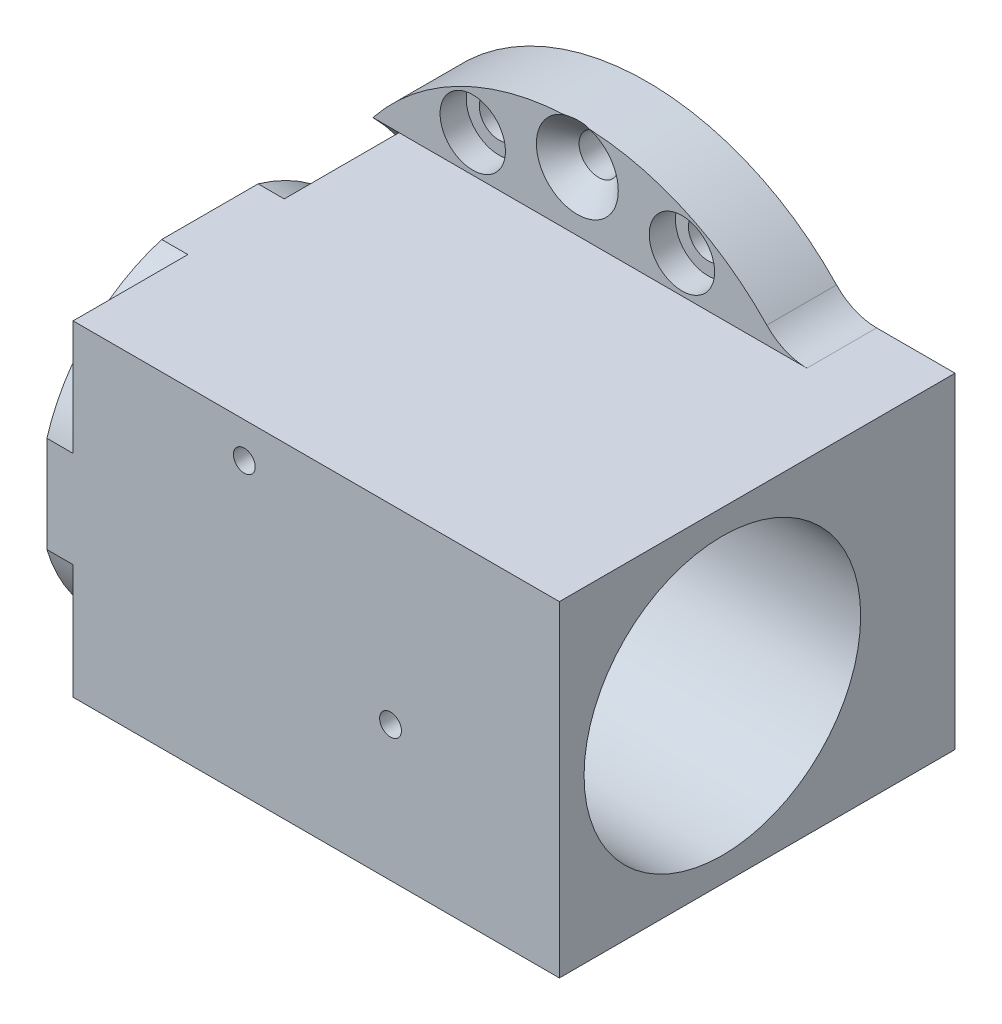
ISO-10303-21;
HEADER;
FILE_DESCRIPTION(('STEP AP214'),'2;1');
FILE_NAME('part.step','',(''),(''),'','','');
FILE_SCHEMA(('AUTOMOTIVE_DESIGN { 1 0 10303 214 1 1 1 1 }'));
ENDSEC;
DATA;
#1=APPLICATION_CONTEXT('core data for automotive mechanical design processes');
#2=APPLICATION_PROTOCOL_DEFINITION('international standard','automotive_design',2000,#1);
#3=PRODUCT_CONTEXT('',#1,'mechanical');
#4=PRODUCT('Part','Part','',(#3));
#5=PRODUCT_RELATED_PRODUCT_CATEGORY('part','',(#4));
#6=PRODUCT_DEFINITION_FORMATION('','',#4);
#7=PRODUCT_DEFINITION_CONTEXT('part definition',#1,'design');
#8=PRODUCT_DEFINITION('design','',#6,#7);
#9=PRODUCT_DEFINITION_SHAPE('','',#8);
#10=(LENGTH_UNIT() NAMED_UNIT(*) SI_UNIT(.MILLI.,.METRE.));
#11=(NAMED_UNIT(*) PLANE_ANGLE_UNIT() SI_UNIT($,.RADIAN.));
#12=(NAMED_UNIT(*) SI_UNIT($,.STERADIAN.) SOLID_ANGLE_UNIT());
#13=UNCERTAINTY_MEASURE_WITH_UNIT(LENGTH_MEASURE(1.E-05),#10,'distance_accuracy_value','');
#14=(GEOMETRIC_REPRESENTATION_CONTEXT(3) GLOBAL_UNCERTAINTY_ASSIGNED_CONTEXT((#13)) GLOBAL_UNIT_ASSIGNED_CONTEXT((#10,
#11,#12)) REPRESENTATION_CONTEXT('',''));
#15=CARTESIAN_POINT('',(0.,0.,0.));
#16=DIRECTION('',(0.,0.,1.));
#17=DIRECTION('',(1.,0.,0.));
#18=AXIS2_PLACEMENT_3D('',#15,#16,#17);
#19=CARTESIAN_POINT('',(-20.458687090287,0.,26.7));
#20=DIRECTION('',(1.,0.,0.));
#21=DIRECTION('',(0.,0.,-1.));
#22=AXIS2_PLACEMENT_3D('',#19,#20,#21);
#23=PLANE('',#22);
#24=CARTESIAN_POINT('',(-20.458687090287,0.,26.7));
#25=DIRECTION('',(-1.,0.,0.));
#26=DIRECTION('',(0.,0.,-1.));
#27=AXIS2_PLACEMENT_3D('',#24,#25,#26);
#28=CIRCLE('',#27,19.5);
#29=CARTESIAN_POINT('',(-20.458687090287,18.7,21.1718900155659));
#30=VERTEX_POINT('',#29);
#31=CARTESIAN_POINT('',(-20.458687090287,-18.7,21.1718900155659));
#32=VERTEX_POINT('',#31);
#33=EDGE_CURVE('E321',#30,#32,#28,.T.);
#34=ORIENTED_EDGE('',*,*,#33,.F.);
#35=DIRECTION('',(0.,0.,-1.));
#36=VECTOR('',#35,1.);
#37=CARTESIAN_POINT('',(-20.458687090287,18.7,45.4));
#38=LINE('',#37,#36);
#39=CARTESIAN_POINT('',(-20.458687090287,18.7,8.));
#40=VERTEX_POINT('',#39);
#41=EDGE_CURVE('E362',#30,#40,#38,.T.);
#42=ORIENTED_EDGE('',*,*,#41,.T.);
#43=CARTESIAN_POINT('',(-20.458687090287,0.,26.7));
#44=DIRECTION('',(1.,0.,0.));
#45=DIRECTION('',(0.,0.,-1.));
#46=AXIS2_PLACEMENT_3D('',#43,#44,#45);
#47=CIRCLE('',#46,26.4457936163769);
#48=CARTESIAN_POINT('',(-20.458687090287,-18.7,8.));
#49=VERTEX_POINT('',#48);
#50=EDGE_CURVE('E364',#49,#40,#47,.T.);
#51=ORIENTED_EDGE('',*,*,#50,.F.);
#52=DIRECTION('',(0.,0.,-1.));
#53=VECTOR('',#52,1.);
#54=CARTESIAN_POINT('',(-20.458687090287,-18.7,45.4));
#55=LINE('',#54,#53);
#56=EDGE_CURVE('E356',#32,#49,#55,.T.);
#57=ORIENTED_EDGE('',*,*,#56,.F.);
#58=EDGE_LOOP('',(#34,#42,#51,#57));
#59=FACE_BOUND('',#58,.T.);
#60=ADVANCED_FACE('F33',(#59),#23,.F.);
#61=CARTESIAN_POINT('',(0.,0.,8.));
#62=DIRECTION('',(0.,0.,1.));
#63=DIRECTION('',(1.,0.,0.));
#64=AXIS2_PLACEMENT_3D('',#61,#62,#63);
#65=PLANE('',#64);
#66=CARTESIAN_POINT('',(-12.,-22.95,8.));
#67=DIRECTION('',(0.,0.,1.));
#68=DIRECTION('',(1.,0.,0.));
#69=AXIS2_PLACEMENT_3D('',#66,#67,#68);
#70=CIRCLE('',#69,3.74999999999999);
#71=CARTESIAN_POINT('',(-8.25,-22.95,8.));
#72=VERTEX_POINT('',#71);
#73=EDGE_CURVE('E502',#72,#72,#70,.T.);
#74=ORIENTED_EDGE('',*,*,#73,.F.);
#75=EDGE_LOOP('',(#74));
#76=FACE_BOUND('',#75,.T.);
#77=CARTESIAN_POINT('',(12.,-22.95,8.));
#78=DIRECTION('',(0.,0.,1.));
#79=DIRECTION('',(1.,0.,0.));
#80=AXIS2_PLACEMENT_3D('',#77,#78,#79);
#81=CIRCLE('',#80,3.74999999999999);
#82=CARTESIAN_POINT('',(15.75,-22.95,8.));
#83=VERTEX_POINT('',#82);
#84=EDGE_CURVE('E490',#83,#83,#81,.T.);
#85=ORIENTED_EDGE('',*,*,#84,.F.);
#86=EDGE_LOOP('',(#85));
#87=FACE_BOUND('',#86,.T.);
#88=CARTESIAN_POINT('',(0.,-25.5,8.));
#89=DIRECTION('',(0.,0.,1.));
#90=DIRECTION('',(1.,0.,0.));
#91=AXIS2_PLACEMENT_3D('',#88,#89,#90);
#92=CIRCLE('',#91,4.69999999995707);
#93=CARTESIAN_POINT('',(1.47085153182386,-29.9639215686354,8.));
#94=VERTEX_POINT('',#93);
#95=CARTESIAN_POINT('',(-1.4708515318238,-29.9639215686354,8.));
#96=VERTEX_POINT('',#95);
#97=EDGE_CURVE('E463',#94,#96,#92,.T.);
#98=ORIENTED_EDGE('',*,*,#97,.F.);
#99=CARTESIAN_POINT('',(0.,0.,8.));
#100=DIRECTION('',(0.,0.,1.));
#101=DIRECTION('',(1.,0.,0.));
#102=AXIS2_PLACEMENT_3D('',#99,#100,#101);
#103=CIRCLE('',#102,30.);
#104=CARTESIAN_POINT('',(23.458687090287,-18.7,8.));
#105=VERTEX_POINT('',#104);
#106=EDGE_CURVE('E173',#94,#105,#103,.T.);
#107=ORIENTED_EDGE('',*,*,#106,.T.);
#108=DIRECTION('',(1.,0.,0.));
#109=VECTOR('',#108,1.);
#110=CARTESIAN_POINT('',(35.341312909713,-18.7,8.));
#111=LINE('',#110,#109);
#112=EDGE_CURVE('E346',#49,#105,#111,.T.);
#113=ORIENTED_EDGE('',*,*,#112,.F.);
#114=DIRECTION('',(1.,0.,0.));
#115=VECTOR('',#114,1.);
#116=CARTESIAN_POINT('',(-61.6523687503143,-18.7,7.99999999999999));
#117=LINE('',#116,#115);
#118=CARTESIAN_POINT('',(-23.458687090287,-18.7,7.99999999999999));
#119=VERTEX_POINT('',#118);
#120=EDGE_CURVE('E367',#119,#49,#117,.T.);
#121=ORIENTED_EDGE('',*,*,#120,.F.);
#122=EDGE_CURVE('E180',#119,#96,#103,.T.);
#123=ORIENTED_EDGE('',*,*,#122,.T.);
#124=EDGE_LOOP('',(#98,#107,#113,#121,#123));
#125=FACE_BOUND('',#124,.T.);
#126=ADVANCED_FACE('F272',(#76,#87,#125),#65,.T.);
#127=CARTESIAN_POINT('',(12.,22.95,8.));
#128=DIRECTION('',(0.,0.,1.));
#129=DIRECTION('',(1.,0.,0.));
#130=AXIS2_PLACEMENT_3D('',#127,#128,#129);
#131=CIRCLE('',#130,3.74999999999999);
#132=CARTESIAN_POINT('',(15.75,22.95,8.));
#133=VERTEX_POINT('',#132);
#134=EDGE_CURVE('E526',#133,#133,#131,.T.);
#135=ORIENTED_EDGE('',*,*,#134,.F.);
#136=EDGE_LOOP('',(#135));
#137=FACE_BOUND('',#136,.T.);
#138=CARTESIAN_POINT('',(-12.,22.95,8.));
#139=DIRECTION('',(0.,0.,1.));
#140=DIRECTION('',(1.,0.,0.));
#141=AXIS2_PLACEMENT_3D('',#138,#139,#140);
#142=CIRCLE('',#141,3.74999999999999);
#143=CARTESIAN_POINT('',(-8.25000000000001,22.95,8.));
#144=VERTEX_POINT('',#143);
#145=EDGE_CURVE('E514',#144,#144,#142,.T.);
#146=ORIENTED_EDGE('',*,*,#145,.F.);
#147=EDGE_LOOP('',(#146));
#148=FACE_BOUND('',#147,.T.);
#149=CARTESIAN_POINT('',(0.,25.5,8.));
#150=DIRECTION('',(0.,0.,1.));
#151=DIRECTION('',(1.,0.,0.));
#152=AXIS2_PLACEMENT_3D('',#149,#150,#151);
#153=CIRCLE('',#152,4.69999999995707);
#154=CARTESIAN_POINT('',(-1.47085153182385,29.9639215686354,8.));
#155=VERTEX_POINT('',#154);
#156=CARTESIAN_POINT('',(1.47085153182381,29.9639215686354,8.));
#157=VERTEX_POINT('',#156);
#158=EDGE_CURVE('E154',#155,#157,#153,.T.);
#159=ORIENTED_EDGE('',*,*,#158,.F.);
#160=CARTESIAN_POINT('',(0.,0.,8.));
#161=DIRECTION('',(0.,0.,1.));
#162=DIRECTION('',(1.,0.,0.));
#163=AXIS2_PLACEMENT_3D('',#160,#161,#162);
#164=CIRCLE('',#163,30.);
#165=CARTESIAN_POINT('',(-23.458687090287,18.7,7.99999999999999));
#166=VERTEX_POINT('',#165);
#167=EDGE_CURVE('E161',#155,#166,#164,.T.);
#168=ORIENTED_EDGE('',*,*,#167,.T.);
#169=DIRECTION('',(1.,0.,0.));
#170=VECTOR('',#169,1.);
#171=CARTESIAN_POINT('',(-61.6523687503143,18.7,7.99999999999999));
#172=LINE('',#171,#170);
#173=EDGE_CURVE('E171',#166,#40,#172,.T.);
#174=ORIENTED_EDGE('',*,*,#173,.T.);
#175=DIRECTION('',(-1.,0.,0.));
#176=VECTOR('',#175,1.);
#177=CARTESIAN_POINT('',(-20.458687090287,18.7,8.));
#178=LINE('',#177,#176);
#179=CARTESIAN_POINT('',(26.3404631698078,18.7,8.));
#180=VERTEX_POINT('',#179);
#181=EDGE_CURVE('E350',#180,#40,#178,.T.);
#182=ORIENTED_EDGE('',*,*,#181,.F.);
#183=CARTESIAN_POINT('',(26.3404631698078,25.05,8.));
#184=DIRECTION('',(0.,0.,1.));
#185=DIRECTION('',(1.,0.,0.));
#186=AXIS2_PLACEMENT_3D('',#183,#184,#185);
#187=CIRCLE('',#186,6.35);
#188=CARTESIAN_POINT('',(21.7390342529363,20.6740027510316,8.));
#189=VERTEX_POINT('',#188);
#190=EDGE_CURVE('E41',#180,#189,#187,.F.);
#191=ORIENTED_EDGE('',*,*,#190,.T.);
#192=EDGE_CURVE('E163',#189,#157,#164,.T.);
#193=ORIENTED_EDGE('',*,*,#192,.T.);
#194=EDGE_LOOP('',(#159,#168,#174,#182,#191,#193));
#195=FACE_BOUND('',#194,.T.);
#196=ADVANCED_FACE('F159',(#137,#148,#195),#65,.T.);
#197=CARTESIAN_POINT('',(0.,0.,0.));
#198=DIRECTION('',(0.,0.,1.));
#199=DIRECTION('',(1.,0.,0.));
#200=AXIS2_PLACEMENT_3D('',#197,#198,#199);
#201=CYLINDRICAL_SURFACE('',#200,30.);
#202=ORIENTED_EDGE('',*,*,#192,.F.);
#203=DIRECTION('',(0.,0.,1.));
#204=VECTOR('',#203,1.);
#205=CARTESIAN_POINT('',(21.7390342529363,20.6740027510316,0.));
#206=LINE('',#205,#204);
#207=CARTESIAN_POINT('',(21.7390342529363,20.6740027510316,0.));
#208=VERTEX_POINT('',#207);
#209=EDGE_CURVE('E48',#189,#208,#206,.F.);
#210=ORIENTED_EDGE('',*,*,#209,.T.);
#211=CARTESIAN_POINT('',(0.,0.,0.));
#212=DIRECTION('',(0.,0.,1.));
#213=DIRECTION('',(1.,0.,0.));
#214=AXIS2_PLACEMENT_3D('',#211,#212,#213);
#215=CIRCLE('',#214,30.);
#216=CARTESIAN_POINT('',(-23.458687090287,18.7,0.));
#217=VERTEX_POINT('',#216);
#218=EDGE_CURVE('E183',#208,#217,#215,.T.);
#219=ORIENTED_EDGE('',*,*,#218,.T.);
#220=DIRECTION('',(0.,0.,1.));
#221=VECTOR('',#220,1.);
#222=CARTESIAN_POINT('',(-23.458687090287,18.7,0.));
#223=LINE('',#222,#221);
#224=EDGE_CURVE('E170',#217,#166,#223,.T.);
#225=ORIENTED_EDGE('',*,*,#224,.T.);
#226=ORIENTED_EDGE('',*,*,#167,.F.);
#227=CARTESIAN_POINT('',(1.47160231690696,29.9638847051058,8.00020000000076));
#228=CARTESIAN_POINT('',(1.39386172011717,29.9677027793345,7.97948521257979));
#229=CARTESIAN_POINT('',(1.31573580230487,29.971236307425,7.96017864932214));
#230=CARTESIAN_POINT('',(1.15875657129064,29.9777160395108,7.92458632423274));
#231=CARTESIAN_POINT('',(1.07990309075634,29.9806621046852,7.90830127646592));
#232=CARTESIAN_POINT('',(0.842264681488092,29.9885928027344,7.86427902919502));
#233=CARTESIAN_POINT('',(0.682506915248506,29.9926647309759,7.84140326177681));
#234=CARTESIAN_POINT('',(0.365301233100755,29.9981855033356,7.81029691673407));
#235=CARTESIAN_POINT('',(0.207886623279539,29.9996934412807,7.80173648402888));
#236=CARTESIAN_POINT('',(-0.106990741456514,30.0002217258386,7.79874422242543));
#237=CARTESIAN_POINT('',(-0.264453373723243,29.9992439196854,7.80430190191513));
#238=CARTESIAN_POINT('',(-0.50945815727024,29.9958037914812,7.82372011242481));
#239=CARTESIAN_POINT('',(-0.597416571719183,29.994179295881,7.83287766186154));
#240=CARTESIAN_POINT('',(-0.772786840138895,29.9901731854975,7.85535907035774));
#241=CARTESIAN_POINT('',(-0.86019869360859,29.9877915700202,7.86868293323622));
#242=CARTESIAN_POINT('',(-1.03546134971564,29.9822549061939,7.89948261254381));
#243=CARTESIAN_POINT('',(-1.12330242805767,29.9790899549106,7.91701149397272));
#244=CARTESIAN_POINT('',(-1.29812798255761,29.972029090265,7.9558444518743));
#245=CARTESIAN_POINT('',(-1.38511236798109,29.9681331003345,7.97714892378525));
#246=CARTESIAN_POINT('',(-1.47160231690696,29.9638847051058,8.00020000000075));
#247=B_SPLINE_CURVE_WITH_KNOTS('',3,(#227,#228,#229,#230,#231,#232,#233,#234,#235,#236,#237,
#238,#239,#240,#241,#242,#243,#244,#245,#246),.UNSPECIFIED.,.F.,.F.,(4,2,2,2,2,2,2,2,2,4),(0.,
0.241605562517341,0.483268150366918,0.966919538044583,1.43926475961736,1.91125906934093,
2.17651538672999,2.44177194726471,2.71057045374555,2.97939712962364),.UNSPECIFIED.);
#248=EDGE_CURVE('E150',#157,#155,#247,.T.);
#249=ORIENTED_EDGE('',*,*,#248,.F.);
#250=EDGE_LOOP('',(#202,#210,#219,#225,#226,#249));
#251=FACE_BOUND('',#250,.T.);
#252=ADVANCED_FACE('F168',(#251),#201,.T.);
#253=CARTESIAN_POINT('',(35.341312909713,18.7,0.));
#254=DIRECTION('',(0.,1.,0.));
#255=DIRECTION('',(-1.,0.,0.));
#256=AXIS2_PLACEMENT_3D('',#253,#254,#255);
#257=PLANE('',#256);
#258=DIRECTION('',(-1.,0.,0.));
#259=VECTOR('',#258,1.);
#260=CARTESIAN_POINT('',(35.341312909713,18.7,0.));
#261=LINE('',#260,#259);
#262=CARTESIAN_POINT('',(35.341312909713,18.7,0.));
#263=VERTEX_POINT('',#262);
#264=CARTESIAN_POINT('',(26.3404631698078,18.7,0.));
#265=VERTEX_POINT('',#264);
#266=EDGE_CURVE('E178',#263,#265,#261,.T.);
#267=ORIENTED_EDGE('',*,*,#266,.T.);
#268=DIRECTION('',(0.,0.,-1.));
#269=VECTOR('',#268,1.);
#270=CARTESIAN_POINT('',(26.3404631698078,18.7,8.));
#271=LINE('',#270,#269);
#272=EDGE_CURVE('E156',#265,#180,#271,.F.);
#273=ORIENTED_EDGE('',*,*,#272,.T.);
#274=ORIENTED_EDGE('',*,*,#181,.T.);
#275=ORIENTED_EDGE('',*,*,#41,.F.);
#276=DIRECTION('',(1.,0.,0.));
#277=VECTOR('',#276,1.);
#278=CARTESIAN_POINT('',(-23.458687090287,18.7,21.1718900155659));
#279=LINE('',#278,#277);
#280=CARTESIAN_POINT('',(-23.458687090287,18.7,21.1718900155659));
#281=VERTEX_POINT('',#280);
#282=EDGE_CURVE('E340',#281,#30,#279,.T.);
#283=ORIENTED_EDGE('',*,*,#282,.F.);
#284=DIRECTION('',(0.,0.,-1.));
#285=VECTOR('',#284,1.);
#286=CARTESIAN_POINT('',(-23.458687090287,18.7,21.1718900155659));
#287=LINE('',#286,#285);
#288=CARTESIAN_POINT('',(-23.458687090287,18.7,32.2281099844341));
#289=VERTEX_POINT('',#288);
#290=EDGE_CURVE('E334',#289,#281,#287,.T.);
#291=ORIENTED_EDGE('',*,*,#290,.F.);
#292=DIRECTION('',(-1.,0.,0.));
#293=VECTOR('',#292,1.);
#294=CARTESIAN_POINT('',(-20.458687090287,18.7,32.2281099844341));
#295=LINE('',#294,#293);
#296=CARTESIAN_POINT('',(-20.458687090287,18.7,32.2281099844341));
#297=VERTEX_POINT('',#296);
#298=EDGE_CURVE('E412',#297,#289,#295,.T.);
#299=ORIENTED_EDGE('',*,*,#298,.F.);
#300=DIRECTION('',(0.,0.,-1.));
#301=VECTOR('',#300,1.);
#302=CARTESIAN_POINT('',(-20.458687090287,18.7,45.4));
#303=LINE('',#302,#301);
#304=CARTESIAN_POINT('',(-20.458687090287,18.7,45.4));
#305=VERTEX_POINT('',#304);
#306=EDGE_CURVE('E419',#305,#297,#303,.T.);
#307=ORIENTED_EDGE('',*,*,#306,.F.);
#308=DIRECTION('',(-1.,0.,0.));
#309=VECTOR('',#308,1.);
#310=CARTESIAN_POINT('',(-20.458687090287,18.7,45.4));
#311=LINE('',#310,#309);
#312=CARTESIAN_POINT('',(35.341312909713,18.7,45.4));
#313=VERTEX_POINT('',#312);
#314=EDGE_CURVE('E353',#313,#305,#311,.T.);
#315=ORIENTED_EDGE('',*,*,#314,.F.);
#316=DIRECTION('',(0.,0.,1.));
#317=VECTOR('',#316,1.);
#318=CARTESIAN_POINT('',(35.341312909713,18.7,0.));
#319=LINE('',#318,#317);
#320=EDGE_CURVE('E184',#263,#313,#319,.T.);
#321=ORIENTED_EDGE('',*,*,#320,.F.);
#322=EDGE_LOOP('',(#267,#273,#274,#275,#283,#291,#299,#307,#315,#321));
#323=FACE_BOUND('',#322,.T.);
#324=ADVANCED_FACE('F285',(#323),#257,.T.);
#325=CARTESIAN_POINT('',(35.341312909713,-18.7,0.));
#326=DIRECTION('',(1.,0.,0.));
#327=DIRECTION('',(0.,1.,0.));
#328=AXIS2_PLACEMENT_3D('',#325,#326,#327);
#329=PLANE('',#328);
#330=CARTESIAN_POINT('',(35.341312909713,0.,26.7));
#331=DIRECTION('',(1.,0.,0.));
#332=DIRECTION('',(0.,1.,0.));
#333=AXIS2_PLACEMENT_3D('',#330,#331,#332);
#334=CIRCLE('',#333,15.86865);
#335=CARTESIAN_POINT('',(35.341312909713,15.86865,26.7));
#336=VERTEX_POINT('',#335);
#337=EDGE_CURVE('E422',#336,#336,#334,.T.);
#338=ORIENTED_EDGE('',*,*,#337,.F.);
#339=EDGE_LOOP('',(#338));
#340=FACE_BOUND('',#339,.T.);
#341=ORIENTED_EDGE('',*,*,#320,.T.);
#342=DIRECTION('',(0.,1.,0.));
#343=VECTOR('',#342,1.);
#344=CARTESIAN_POINT('',(35.341312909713,18.7,45.4));
#345=LINE('',#344,#343);
#346=CARTESIAN_POINT('',(35.341312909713,-18.7,45.4));
#347=VERTEX_POINT('',#346);
#348=EDGE_CURVE('E349',#347,#313,#345,.T.);
#349=ORIENTED_EDGE('',*,*,#348,.F.);
#350=DIRECTION('',(0.,0.,1.));
#351=VECTOR('',#350,1.);
#352=CARTESIAN_POINT('',(35.341312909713,-18.7,0.));
#353=LINE('',#352,#351);
#354=CARTESIAN_POINT('',(35.341312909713,-18.7,0.));
#355=VERTEX_POINT('',#354);
#356=EDGE_CURVE('E186',#355,#347,#353,.T.);
#357=ORIENTED_EDGE('',*,*,#356,.F.);
#358=DIRECTION('',(0.,1.,0.));
#359=VECTOR('',#358,1.);
#360=CARTESIAN_POINT('',(35.341312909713,-18.7,0.));
#361=LINE('',#360,#359);
#362=EDGE_CURVE('E381',#355,#263,#361,.T.);
#363=ORIENTED_EDGE('',*,*,#362,.T.);
#364=EDGE_LOOP('',(#341,#349,#357,#363));
#365=FACE_BOUND('',#364,.T.);
#366=ADVANCED_FACE('F288',(#340,#365),#329,.T.);
#367=CARTESIAN_POINT('',(23.458687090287,-18.7,0.));
#368=DIRECTION('',(0.,-1.,0.));
#369=DIRECTION('',(0.,0.,-1.));
#370=AXIS2_PLACEMENT_3D('',#367,#368,#369);
#371=PLANE('',#370);
#372=CARTESIAN_POINT('',(-12.4586870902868,-18.7,39.4000000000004));
#373=DIRECTION('',(0.,-1.,0.));
#374=DIRECTION('',(0.,0.,-1.));
#375=AXIS2_PLACEMENT_3D('',#372,#373,#374);
#376=CIRCLE('',#375,1.64999999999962);
#377=CARTESIAN_POINT('',(-12.4586870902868,-18.7,37.7500000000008));
#378=VERTEX_POINT('',#377);
#379=EDGE_CURVE('E302',#378,#378,#376,.T.);
#380=ORIENTED_EDGE('',*,*,#379,.F.);
#381=EDGE_LOOP('',(#380));
#382=FACE_BOUND('',#381,.T.);
#383=CARTESIAN_POINT('',(29.4413129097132,-18.7,39.4000000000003));
#384=DIRECTION('',(0.,-1.,0.));
#385=DIRECTION('',(0.,0.,-1.));
#386=AXIS2_PLACEMENT_3D('',#383,#384,#385);
#387=CIRCLE('',#386,1.64999999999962);
#388=CARTESIAN_POINT('',(29.4413129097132,-18.7,37.7500000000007));
#389=VERTEX_POINT('',#388);
#390=EDGE_CURVE('E306',#389,#389,#387,.T.);
#391=ORIENTED_EDGE('',*,*,#390,.F.);
#392=EDGE_LOOP('',(#391));
#393=FACE_BOUND('',#392,.T.);
#394=CARTESIAN_POINT('',(29.4413129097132,-18.7,5.90000000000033));
#395=DIRECTION('',(0.,-1.,0.));
#396=DIRECTION('',(0.,0.,-1.));
#397=AXIS2_PLACEMENT_3D('',#394,#395,#396);
#398=CIRCLE('',#397,1.64999999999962);
#399=CARTESIAN_POINT('',(29.4413129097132,-18.7,4.25000000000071));
#400=VERTEX_POINT('',#399);
#401=EDGE_CURVE('E310',#400,#400,#398,.T.);
#402=ORIENTED_EDGE('',*,*,#401,.F.);
#403=EDGE_LOOP('',(#402));
#404=FACE_BOUND('',#403,.T.);
#405=DIRECTION('',(-1.,0.,0.));
#406=VECTOR('',#405,1.);
#407=CARTESIAN_POINT('',(-20.458687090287,-18.7,32.2281099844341));
#408=LINE('',#407,#406);
#409=CARTESIAN_POINT('',(-20.458687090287,-18.7,32.2281099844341));
#410=VERTEX_POINT('',#409);
#411=CARTESIAN_POINT('',(-23.458687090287,-18.7,32.2281099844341));
#412=VERTEX_POINT('',#411);
#413=EDGE_CURVE('E313',#410,#412,#408,.T.);
#414=ORIENTED_EDGE('',*,*,#413,.T.);
#415=DIRECTION('',(0.,0.,1.));
#416=VECTOR('',#415,1.);
#417=CARTESIAN_POINT('',(-23.458687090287,-18.7,45.4));
#418=LINE('',#417,#416);
#419=CARTESIAN_POINT('',(-23.458687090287,-18.7,21.1718900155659));
#420=VERTEX_POINT('',#419);
#421=EDGE_CURVE('E315',#420,#412,#418,.T.);
#422=ORIENTED_EDGE('',*,*,#421,.F.);
#423=DIRECTION('',(1.,0.,0.));
#424=VECTOR('',#423,1.);
#425=CARTESIAN_POINT('',(-23.458687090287,-18.7,21.1718900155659));
#426=LINE('',#425,#424);
#427=EDGE_CURVE('E344',#420,#32,#426,.T.);
#428=ORIENTED_EDGE('',*,*,#427,.T.);
#429=ORIENTED_EDGE('',*,*,#56,.T.);
#430=ORIENTED_EDGE('',*,*,#112,.T.);
#431=DIRECTION('',(0.,0.,1.));
#432=VECTOR('',#431,1.);
#433=CARTESIAN_POINT('',(23.458687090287,-18.7,0.));
#434=LINE('',#433,#432);
#435=CARTESIAN_POINT('',(23.458687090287,-18.7,0.));
#436=VERTEX_POINT('',#435);
#437=EDGE_CURVE('E189',#436,#105,#434,.T.);
#438=ORIENTED_EDGE('',*,*,#437,.F.);
#439=DIRECTION('',(1.,0.,0.));
#440=VECTOR('',#439,1.);
#441=CARTESIAN_POINT('',(23.458687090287,-18.7,0.));
#442=LINE('',#441,#440);
#443=EDGE_CURVE('E379',#436,#355,#442,.T.);
#444=ORIENTED_EDGE('',*,*,#443,.T.);
#445=ORIENTED_EDGE('',*,*,#356,.T.);
#446=DIRECTION('',(1.,0.,0.));
#447=VECTOR('',#446,1.);
#448=CARTESIAN_POINT('',(35.341312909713,-18.7,45.4));
#449=LINE('',#448,#447);
#450=CARTESIAN_POINT('',(-20.458687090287,-18.7,45.4));
#451=VERTEX_POINT('',#450);
#452=EDGE_CURVE('E347',#451,#347,#449,.T.);
#453=ORIENTED_EDGE('',*,*,#452,.F.);
#454=DIRECTION('',(0.,0.,1.));
#455=VECTOR('',#454,1.);
#456=CARTESIAN_POINT('',(-20.458687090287,-18.7,32.2281099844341));
#457=LINE('',#456,#455);
#458=EDGE_CURVE('E318',#410,#451,#457,.T.);
#459=ORIENTED_EDGE('',*,*,#458,.F.);
#460=EDGE_LOOP('',(#414,#422,#428,#429,#430,#438,#444,#445,#453,#459));
#461=FACE_BOUND('',#460,.T.);
#462=ADVANCED_FACE('F291',(#382,#393,#404,#461),#371,.T.);
#463=CARTESIAN_POINT('',(0.,0.,0.));
#464=DIRECTION('',(0.,0.,1.));
#465=DIRECTION('',(1.,0.,0.));
#466=AXIS2_PLACEMENT_3D('',#463,#464,#465);
#467=CYLINDRICAL_SURFACE('',#466,30.);
#468=CARTESIAN_POINT('',(-1.47160231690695,-29.9638847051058,8.00020000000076));
#469=CARTESIAN_POINT('',(-1.39386172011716,-29.9677027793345,7.97948521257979));
#470=CARTESIAN_POINT('',(-1.31573580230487,-29.971236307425,7.96017864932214));
#471=CARTESIAN_POINT('',(-1.15875657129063,-29.9777160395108,7.92458632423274));
#472=CARTESIAN_POINT('',(-1.07990309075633,-29.9806621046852,7.90830127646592));
#473=CARTESIAN_POINT('',(-0.842264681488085,-29.9885928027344,7.86427902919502));
#474=CARTESIAN_POINT('',(-0.682506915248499,-29.9926647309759,7.84140326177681));
#475=CARTESIAN_POINT('',(-0.365301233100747,-29.9981855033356,7.81029691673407));
#476=CARTESIAN_POINT('',(-0.207886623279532,-29.9996934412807,7.80173648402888));
#477=CARTESIAN_POINT('',(0.106990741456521,-30.0002217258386,7.79874422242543));
#478=CARTESIAN_POINT('',(0.26445337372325,-29.9992439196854,7.80430190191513));
#479=CARTESIAN_POINT('',(0.509458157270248,-29.9958037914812,7.82372011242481));
#480=CARTESIAN_POINT('',(0.597416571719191,-29.994179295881,7.83287766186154));
#481=CARTESIAN_POINT('',(0.772786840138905,-29.9901731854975,7.85535907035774));
#482=CARTESIAN_POINT('',(0.8601986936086,-29.9877915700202,7.86868293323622));
#483=CARTESIAN_POINT('',(1.03546134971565,-29.9822549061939,7.89948261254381));
#484=CARTESIAN_POINT('',(1.12330242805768,-29.9790899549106,7.91701149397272));
#485=CARTESIAN_POINT('',(1.29812798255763,-29.972029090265,7.9558444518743));
#486=CARTESIAN_POINT('',(1.3851123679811,-29.9681331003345,7.97714892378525));
#487=CARTESIAN_POINT('',(1.47160231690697,-29.9638847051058,8.00020000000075));
#488=B_SPLINE_CURVE_WITH_KNOTS('',3,(#468,#469,#470,#471,#472,#473,#474,#475,#476,#477,#478,
#479,#480,#481,#482,#483,#484,#485,#486,#487),.UNSPECIFIED.,.F.,.F.,(4,2,2,2,2,2,2,2,2,4),(0.,
0.241605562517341,0.483268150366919,0.966919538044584,1.43926475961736,1.91125906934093,
2.17651538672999,2.44177194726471,2.71057045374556,2.97939712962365),.UNSPECIFIED.);
#489=EDGE_CURVE('E157',#96,#94,#488,.T.);
#490=ORIENTED_EDGE('',*,*,#489,.F.);
#491=ORIENTED_EDGE('',*,*,#122,.F.);
#492=DIRECTION('',(0.,0.,1.));
#493=VECTOR('',#492,1.);
#494=CARTESIAN_POINT('',(-23.458687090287,-18.7,0.));
#495=LINE('',#494,#493);
#496=CARTESIAN_POINT('',(-23.458687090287,-18.7,0.));
#497=VERTEX_POINT('',#496);
#498=EDGE_CURVE('E192',#497,#119,#495,.T.);
#499=ORIENTED_EDGE('',*,*,#498,.F.);
#500=CARTESIAN_POINT('',(0.,0.,0.));
#501=DIRECTION('',(0.,0.,1.));
#502=DIRECTION('',(1.,0.,0.));
#503=AXIS2_PLACEMENT_3D('',#500,#501,#502);
#504=CIRCLE('',#503,30.);
#505=EDGE_CURVE('E376',#497,#436,#504,.T.);
#506=ORIENTED_EDGE('',*,*,#505,.T.);
#507=ORIENTED_EDGE('',*,*,#437,.T.);
#508=ORIENTED_EDGE('',*,*,#106,.F.);
#509=EDGE_LOOP('',(#490,#491,#499,#506,#507,#508));
#510=FACE_BOUND('',#509,.T.);
#511=ADVANCED_FACE('F206',(#510),#467,.T.);
#512=CARTESIAN_POINT('',(-23.458687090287,18.7,0.));
#513=DIRECTION('',(-1.,0.,0.));
#514=DIRECTION('',(0.,0.,1.));
#515=AXIS2_PLACEMENT_3D('',#512,#513,#514);
#516=PLANE('',#515);
#517=CARTESIAN_POINT('',(-23.458687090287,0.,26.7));
#518=DIRECTION('',(-1.,0.,0.));
#519=DIRECTION('',(0.,0.,1.));
#520=AXIS2_PLACEMENT_3D('',#517,#518,#519);
#521=CIRCLE('',#520,26.4457936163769);
#522=EDGE_CURVE('E174',#119,#166,#521,.F.);
#523=ORIENTED_EDGE('',*,*,#522,.T.);
#524=ORIENTED_EDGE('',*,*,#224,.F.);
#525=DIRECTION('',(0.,-1.,0.));
#526=VECTOR('',#525,1.);
#527=CARTESIAN_POINT('',(-23.458687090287,18.7,0.));
#528=LINE('',#527,#526);
#529=EDGE_CURVE('E373',#217,#497,#528,.T.);
#530=ORIENTED_EDGE('',*,*,#529,.T.);
#531=ORIENTED_EDGE('',*,*,#498,.T.);
#532=EDGE_LOOP('',(#523,#524,#530,#531));
#533=FACE_BOUND('',#532,.T.);
#534=ADVANCED_FACE('F280',(#533),#516,.T.);
#535=CARTESIAN_POINT('',(0.,0.,0.));
#536=DIRECTION('',(0.,0.,1.));
#537=DIRECTION('',(1.,0.,0.));
#538=AXIS2_PLACEMENT_3D('',#535,#536,#537);
#539=PLANE('',#538);
#540=CARTESIAN_POINT('',(12.,22.95,0.));
#541=DIRECTION('',(0.,0.,1.));
#542=DIRECTION('',(1.,0.,0.));
#543=AXIS2_PLACEMENT_3D('',#540,#541,#542);
#544=CIRCLE('',#543,2.25000000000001);
#545=CARTESIAN_POINT('',(14.25,22.95,0.));
#546=VERTEX_POINT('',#545);
#547=EDGE_CURVE('E517',#546,#546,#544,.T.);
#548=ORIENTED_EDGE('',*,*,#547,.T.);
#549=EDGE_LOOP('',(#548));
#550=FACE_BOUND('',#549,.T.);
#551=CARTESIAN_POINT('',(-12.,22.95,0.));
#552=DIRECTION('',(0.,0.,1.));
#553=DIRECTION('',(1.,0.,0.));
#554=AXIS2_PLACEMENT_3D('',#551,#552,#553);
#555=CIRCLE('',#554,2.25000000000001);
#556=CARTESIAN_POINT('',(-9.74999999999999,22.95,0.));
#557=VERTEX_POINT('',#556);
#558=EDGE_CURVE('E505',#557,#557,#555,.T.);
#559=ORIENTED_EDGE('',*,*,#558,.T.);
#560=EDGE_LOOP('',(#559));
#561=FACE_BOUND('',#560,.T.);
#562=CARTESIAN_POINT('',(-12.,-22.95,0.));
#563=DIRECTION('',(0.,0.,1.));
#564=DIRECTION('',(1.,0.,0.));
#565=AXIS2_PLACEMENT_3D('',#562,#563,#564);
#566=CIRCLE('',#565,2.25000000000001);
#567=CARTESIAN_POINT('',(-9.74999999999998,-22.95,0.));
#568=VERTEX_POINT('',#567);
#569=EDGE_CURVE('E493',#568,#568,#566,.T.);
#570=ORIENTED_EDGE('',*,*,#569,.T.);
#571=EDGE_LOOP('',(#570));
#572=FACE_BOUND('',#571,.T.);
#573=CARTESIAN_POINT('',(12.,-22.95,0.));
#574=DIRECTION('',(0.,0.,1.));
#575=DIRECTION('',(1.,0.,0.));
#576=AXIS2_PLACEMENT_3D('',#573,#574,#575);
#577=CIRCLE('',#576,2.25000000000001);
#578=CARTESIAN_POINT('',(14.25,-22.95,0.));
#579=VERTEX_POINT('',#578);
#580=EDGE_CURVE('E481',#579,#579,#577,.T.);
#581=ORIENTED_EDGE('',*,*,#580,.T.);
#582=EDGE_LOOP('',(#581));
#583=FACE_BOUND('',#582,.T.);
#584=CARTESIAN_POINT('',(0.,25.5,0.));
#585=DIRECTION('',(0.,0.,1.));
#586=DIRECTION('',(1.,0.,0.));
#587=AXIS2_PLACEMENT_3D('',#584,#585,#586);
#588=CIRCLE('',#587,2.24999999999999);
#589=CARTESIAN_POINT('',(2.24999999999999,25.5,0.));
#590=VERTEX_POINT('',#589);
#591=EDGE_CURVE('E465',#590,#590,#588,.T.);
#592=ORIENTED_EDGE('',*,*,#591,.T.);
#593=EDGE_LOOP('',(#592));
#594=FACE_BOUND('',#593,.T.);
#595=CARTESIAN_POINT('',(0.,-25.5,0.));
#596=DIRECTION('',(0.,0.,1.));
#597=DIRECTION('',(1.,0.,0.));
#598=AXIS2_PLACEMENT_3D('',#595,#596,#597);
#599=CIRCLE('',#598,2.24999999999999);
#600=CARTESIAN_POINT('',(2.24999999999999,-25.5,0.));
#601=VERTEX_POINT('',#600);
#602=EDGE_CURVE('E457',#601,#601,#599,.T.);
#603=ORIENTED_EDGE('',*,*,#602,.T.);
#604=EDGE_LOOP('',(#603));
#605=FACE_BOUND('',#604,.T.);
#606=ORIENTED_EDGE('',*,*,#218,.F.);
#607=CARTESIAN_POINT('',(26.3404631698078,25.05,0.));
#608=DIRECTION('',(0.,0.,1.));
#609=DIRECTION('',(1.,0.,0.));
#610=AXIS2_PLACEMENT_3D('',#607,#608,#609);
#611=CIRCLE('',#610,6.35);
#612=EDGE_CURVE('E11',#208,#265,#611,.T.);
#613=ORIENTED_EDGE('',*,*,#612,.T.);
#614=ORIENTED_EDGE('',*,*,#266,.F.);
#615=ORIENTED_EDGE('',*,*,#362,.F.);
#616=ORIENTED_EDGE('',*,*,#443,.F.);
#617=ORIENTED_EDGE('',*,*,#505,.F.);
#618=ORIENTED_EDGE('',*,*,#529,.F.);
#619=EDGE_LOOP('',(#606,#613,#614,#615,#616,#617,#618));
#620=FACE_BOUND('',#619,.T.);
#621=ADVANCED_FACE('F276',(#550,#561,#572,#583,#594,#605,#620),#539,.F.);
#622=CARTESIAN_POINT('',(-61.6523687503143,0.,26.7));
#623=DIRECTION('',(1.,0.,0.));
#624=DIRECTION('',(0.,0.,-1.));
#625=AXIS2_PLACEMENT_3D('',#622,#623,#624);
#626=CYLINDRICAL_SURFACE('',#625,26.4457936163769);
#627=ORIENTED_EDGE('',*,*,#120,.T.);
#628=ORIENTED_EDGE('',*,*,#50,.T.);
#629=ORIENTED_EDGE('',*,*,#173,.F.);
#630=ORIENTED_EDGE('',*,*,#522,.F.);
#631=EDGE_LOOP('',(#627,#628,#629,#630));
#632=FACE_BOUND('',#631,.T.);
#633=ADVANCED_FACE('F268',(#632),#626,.F.);
#634=CARTESIAN_POINT('',(0.,0.,45.4));
#635=DIRECTION('',(0.,0.,-1.));
#636=DIRECTION('',(-1.,0.,0.));
#637=AXIS2_PLACEMENT_3D('',#634,#635,#636);
#638=PLANE('',#637);
#639=CARTESIAN_POINT('',(15.9651466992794,-3.20000000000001,45.4));
#640=DIRECTION('',(0.,0.,1.));
#641=DIRECTION('',(1.,0.,0.));
#642=AXIS2_PLACEMENT_3D('',#639,#640,#641);
#643=CIRCLE('',#642,1.24999999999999);
#644=CARTESIAN_POINT('',(17.2151466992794,-3.20000000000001,45.4));
#645=VERTEX_POINT('',#644);
#646=EDGE_CURVE('E542',#645,#645,#643,.T.);
#647=ORIENTED_EDGE('',*,*,#646,.F.);
#648=EDGE_LOOP('',(#647));
#649=FACE_BOUND('',#648,.T.);
#650=CARTESIAN_POINT('',(-0.808687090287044,14.63,45.4));
#651=DIRECTION('',(0.,0.,1.));
#652=DIRECTION('',(1.,0.,0.));
#653=AXIS2_PLACEMENT_3D('',#650,#651,#652);
#654=CIRCLE('',#653,1.24999999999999);
#655=CARTESIAN_POINT('',(0.441312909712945,14.63,45.4));
#656=VERTEX_POINT('',#655);
#657=EDGE_CURVE('E532',#656,#656,#654,.T.);
#658=ORIENTED_EDGE('',*,*,#657,.F.);
#659=EDGE_LOOP('',(#658));
#660=FACE_BOUND('',#659,.T.);
#661=DIRECTION('',(0.,1.,0.));
#662=VECTOR('',#661,1.);
#663=CARTESIAN_POINT('',(-20.458687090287,5.52810998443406,45.4));
#664=LINE('',#663,#662);
#665=CARTESIAN_POINT('',(-20.458687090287,5.52810998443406,45.4));
#666=VERTEX_POINT('',#665);
#667=EDGE_CURVE('E416',#666,#305,#664,.T.);
#668=ORIENTED_EDGE('',*,*,#667,.F.);
#669=DIRECTION('',(-1.,0.,0.));
#670=VECTOR('',#669,1.);
#671=CARTESIAN_POINT('',(-20.458687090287,5.52810998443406,45.4));
#672=LINE('',#671,#670);
#673=CARTESIAN_POINT('',(-23.458687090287,5.52810998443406,45.4));
#674=VERTEX_POINT('',#673);
#675=EDGE_CURVE('E428',#666,#674,#672,.T.);
#676=ORIENTED_EDGE('',*,*,#675,.T.);
#677=DIRECTION('',(0.,1.,0.));
#678=VECTOR('',#677,1.);
#679=CARTESIAN_POINT('',(-23.458687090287,18.7,45.4));
#680=LINE('',#679,#678);
#681=CARTESIAN_POINT('',(-23.458687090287,-5.52810998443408,45.4));
#682=VERTEX_POINT('',#681);
#683=EDGE_CURVE('E332',#682,#674,#680,.T.);
#684=ORIENTED_EDGE('',*,*,#683,.F.);
#685=DIRECTION('',(-1.,0.,0.));
#686=VECTOR('',#685,1.);
#687=CARTESIAN_POINT('',(-20.458687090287,-5.52810998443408,45.4));
#688=LINE('',#687,#686);
#689=CARTESIAN_POINT('',(-20.458687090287,-5.52810998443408,45.4));
#690=VERTEX_POINT('',#689);
#691=EDGE_CURVE('E322',#690,#682,#688,.T.);
#692=ORIENTED_EDGE('',*,*,#691,.F.);
#693=DIRECTION('',(0.,1.,0.));
#694=VECTOR('',#693,1.);
#695=CARTESIAN_POINT('',(-20.458687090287,-18.7,45.4));
#696=LINE('',#695,#694);
#697=EDGE_CURVE('E432',#451,#690,#696,.T.);
#698=ORIENTED_EDGE('',*,*,#697,.F.);
#699=ORIENTED_EDGE('',*,*,#452,.T.);
#700=ORIENTED_EDGE('',*,*,#348,.T.);
#701=ORIENTED_EDGE('',*,*,#314,.T.);
#702=EDGE_LOOP('',(#668,#676,#684,#692,#698,#699,#700,#701));
#703=FACE_BOUND('',#702,.T.);
#704=ADVANCED_FACE('F264',(#649,#660,#703),#638,.F.);
#705=CARTESIAN_POINT('',(-23.458687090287,0.,26.7));
#706=DIRECTION('',(1.,0.,0.));
#707=DIRECTION('',(0.,0.,-1.));
#708=AXIS2_PLACEMENT_3D('',#705,#706,#707);
#709=CYLINDRICAL_SURFACE('',#708,19.5);
#710=ORIENTED_EDGE('',*,*,#33,.T.);
#711=ORIENTED_EDGE('',*,*,#427,.F.);
#712=CARTESIAN_POINT('',(-23.458687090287,0.,26.7));
#713=DIRECTION('',(-1.,0.,0.));
#714=DIRECTION('',(0.,0.,-1.));
#715=AXIS2_PLACEMENT_3D('',#712,#713,#714);
#716=CIRCLE('',#715,19.5);
#717=EDGE_CURVE('E330',#281,#420,#716,.T.);
#718=ORIENTED_EDGE('',*,*,#717,.F.);
#719=ORIENTED_EDGE('',*,*,#282,.T.);
#720=EDGE_LOOP('',(#710,#711,#718,#719));
#721=FACE_BOUND('',#720,.T.);
#722=ADVANCED_FACE('F260',(#721),#709,.T.);
#723=CARTESIAN_POINT('',(-23.458687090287,0.,26.7));
#724=DIRECTION('',(1.,0.,0.));
#725=DIRECTION('',(0.,0.,-1.));
#726=AXIS2_PLACEMENT_3D('',#723,#724,#725);
#727=PLANE('',#726);
#728=CARTESIAN_POINT('',(-23.458687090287,0.,26.7));
#729=DIRECTION('',(1.,0.,0.));
#730=DIRECTION('',(0.,1.,0.));
#731=AXIS2_PLACEMENT_3D('',#728,#729,#730);
#732=CIRCLE('',#731,15.86865);
#733=CARTESIAN_POINT('',(-23.458687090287,15.86865,26.7));
#734=VERTEX_POINT('',#733);
#735=EDGE_CURVE('E417',#734,#734,#732,.T.);
#736=ORIENTED_EDGE('',*,*,#735,.T.);
#737=EDGE_LOOP('',(#736));
#738=FACE_BOUND('',#737,.T.);
#739=ORIENTED_EDGE('',*,*,#683,.T.);
#740=CARTESIAN_POINT('',(-23.458687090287,0.,26.7));
#741=DIRECTION('',(1.,0.,0.));
#742=DIRECTION('',(0.,0.,-1.));
#743=AXIS2_PLACEMENT_3D('',#740,#741,#742);
#744=CIRCLE('',#743,19.5);
#745=EDGE_CURVE('E414',#289,#674,#744,.T.);
#746=ORIENTED_EDGE('',*,*,#745,.F.);
#747=ORIENTED_EDGE('',*,*,#290,.T.);
#748=ORIENTED_EDGE('',*,*,#717,.T.);
#749=ORIENTED_EDGE('',*,*,#421,.T.);
#750=CARTESIAN_POINT('',(-23.458687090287,0.,26.7));
#751=DIRECTION('',(1.,0.,0.));
#752=DIRECTION('',(0.,0.,-1.));
#753=AXIS2_PLACEMENT_3D('',#750,#751,#752);
#754=CIRCLE('',#753,19.5);
#755=EDGE_CURVE('E327',#682,#412,#754,.T.);
#756=ORIENTED_EDGE('',*,*,#755,.F.);
#757=EDGE_LOOP('',(#739,#746,#747,#748,#749,#756));
#758=FACE_BOUND('',#757,.T.);
#759=ADVANCED_FACE('F256',(#738,#758),#727,.F.);
#760=CARTESIAN_POINT('',(-20.458687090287,0.,26.7));
#761=DIRECTION('',(-1.,0.,0.));
#762=DIRECTION('',(0.,0.,1.));
#763=AXIS2_PLACEMENT_3D('',#760,#761,#762);
#764=CYLINDRICAL_SURFACE('',#763,19.5);
#765=ORIENTED_EDGE('',*,*,#755,.T.);
#766=ORIENTED_EDGE('',*,*,#413,.F.);
#767=CARTESIAN_POINT('',(-20.458687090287,0.,26.7));
#768=DIRECTION('',(1.,0.,0.));
#769=DIRECTION('',(0.,0.,-1.));
#770=AXIS2_PLACEMENT_3D('',#767,#768,#769);
#771=CIRCLE('',#770,19.5);
#772=EDGE_CURVE('E434',#690,#410,#771,.T.);
#773=ORIENTED_EDGE('',*,*,#772,.F.);
#774=ORIENTED_EDGE('',*,*,#691,.T.);
#775=EDGE_LOOP('',(#765,#766,#773,#774));
#776=FACE_BOUND('',#775,.T.);
#777=ADVANCED_FACE('F252',(#776),#764,.T.);
#778=CARTESIAN_POINT('',(-20.458687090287,0.,26.7));
#779=DIRECTION('',(1.,0.,0.));
#780=DIRECTION('',(0.,0.,-1.));
#781=AXIS2_PLACEMENT_3D('',#778,#779,#780);
#782=PLANE('',#781);
#783=ORIENTED_EDGE('',*,*,#458,.T.);
#784=ORIENTED_EDGE('',*,*,#697,.T.);
#785=ORIENTED_EDGE('',*,*,#772,.T.);
#786=EDGE_LOOP('',(#783,#784,#785));
#787=FACE_BOUND('',#786,.T.);
#788=ADVANCED_FACE('F248',(#787),#782,.F.);
#789=CARTESIAN_POINT('',(-20.458687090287,0.,26.7));
#790=DIRECTION('',(-1.,0.,0.));
#791=DIRECTION('',(0.,0.,1.));
#792=AXIS2_PLACEMENT_3D('',#789,#790,#791);
#793=CYLINDRICAL_SURFACE('',#792,19.5);
#794=ORIENTED_EDGE('',*,*,#745,.T.);
#795=ORIENTED_EDGE('',*,*,#675,.F.);
#796=CARTESIAN_POINT('',(-20.458687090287,0.,26.7));
#797=DIRECTION('',(1.,0.,0.));
#798=DIRECTION('',(0.,0.,-1.));
#799=AXIS2_PLACEMENT_3D('',#796,#797,#798);
#800=CIRCLE('',#799,19.5);
#801=EDGE_CURVE('E426',#297,#666,#800,.T.);
#802=ORIENTED_EDGE('',*,*,#801,.F.);
#803=ORIENTED_EDGE('',*,*,#298,.T.);
#804=EDGE_LOOP('',(#794,#795,#802,#803));
#805=FACE_BOUND('',#804,.T.);
#806=ADVANCED_FACE('F244',(#805),#793,.T.);
#807=CARTESIAN_POINT('',(-20.458687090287,0.,26.7));
#808=DIRECTION('',(1.,0.,0.));
#809=DIRECTION('',(0.,0.,-1.));
#810=AXIS2_PLACEMENT_3D('',#807,#808,#809);
#811=PLANE('',#810);
#812=ORIENTED_EDGE('',*,*,#667,.T.);
#813=ORIENTED_EDGE('',*,*,#306,.T.);
#814=ORIENTED_EDGE('',*,*,#801,.T.);
#815=EDGE_LOOP('',(#812,#813,#814));
#816=FACE_BOUND('',#815,.T.);
#817=ADVANCED_FACE('F240',(#816),#811,.F.);
#818=CARTESIAN_POINT('',(-23.458687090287,0.,26.7));
#819=DIRECTION('',(1.,0.,0.));
#820=DIRECTION('',(0.,1.,0.));
#821=AXIS2_PLACEMENT_3D('',#818,#819,#820);
#822=CYLINDRICAL_SURFACE('',#821,15.86865);
#823=ORIENTED_EDGE('',*,*,#735,.F.);
#824=EDGE_LOOP('',(#823));
#825=FACE_BOUND('',#824,.T.);
#826=CARTESIAN_POINT('',(1.94131290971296,0.,26.7));
#827=DIRECTION('',(1.,0.,0.));
#828=DIRECTION('',(0.,1.,0.));
#829=AXIS2_PLACEMENT_3D('',#826,#827,#828);
#830=CIRCLE('',#829,15.86865);
#831=CARTESIAN_POINT('',(1.94131290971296,15.86865,26.7));
#832=VERTEX_POINT('',#831);
#833=EDGE_CURVE('E454',#832,#832,#830,.T.);
#834=ORIENTED_EDGE('',*,*,#833,.T.);
#835=EDGE_LOOP('',(#834));
#836=FACE_BOUND('',#835,.T.);
#837=ADVANCED_FACE('F236',(#825,#836),#822,.F.);
#838=CARTESIAN_POINT('',(-23.458687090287,0.,26.7));
#839=DIRECTION('',(1.,0.,0.));
#840=DIRECTION('',(0.,1.,0.));
#841=AXIS2_PLACEMENT_3D('',#838,#839,#840);
#842=CYLINDRICAL_SURFACE('',#841,15.86865);
#843=CARTESIAN_POINT('',(17.2151466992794,-3.20000000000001,42.2426526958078));
#844=CARTESIAN_POINT('',(17.2151439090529,-3.12953416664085,42.2571599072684));
#845=CARTESIAN_POINT('',(17.2091707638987,-3.05892487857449,42.2711932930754));
#846=CARTESIAN_POINT('',(17.1853104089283,-2.9194370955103,42.2979484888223));
#847=CARTESIAN_POINT('',(17.167411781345,-2.85056032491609,42.3106690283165));
#848=CARTESIAN_POINT('',(17.1200676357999,-2.71656869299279,42.3345431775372));
#849=CARTESIAN_POINT('',(17.0906182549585,-2.6514550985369,42.3456962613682));
#850=CARTESIAN_POINT('',(17.0209221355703,-2.52700425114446,42.366278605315));
#851=CARTESIAN_POINT('',(16.9806780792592,-2.46766556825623,42.375708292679));
#852=CARTESIAN_POINT('',(16.8910895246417,-2.35731735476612,42.3926794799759));
#853=CARTESIAN_POINT('',(16.8418719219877,-2.30620837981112,42.4002442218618));
#854=CARTESIAN_POINT('',(16.735370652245,-2.21295180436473,42.4136603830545));
#855=CARTESIAN_POINT('',(16.6780872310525,-2.17080393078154,42.4195118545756));
#856=CARTESIAN_POINT('',(16.5578293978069,-2.09721373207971,42.4294982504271));
#857=CARTESIAN_POINT('',(16.4949312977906,-2.06564932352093,42.4336528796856));
#858=CARTESIAN_POINT('',(16.3646631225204,-2.01348885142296,42.4404133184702));
#859=CARTESIAN_POINT('',(16.2972932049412,-1.99289240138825,42.4430191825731));
#860=CARTESIAN_POINT('',(16.1603823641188,-1.96336698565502,42.4467287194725));
#861=CARTESIAN_POINT('',(16.0908549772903,-1.95437621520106,42.447840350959));
#862=CARTESIAN_POINT('',(15.9512672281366,-1.9481261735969,42.4486147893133));
#863=CARTESIAN_POINT('',(15.8812068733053,-1.95086673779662,42.4482776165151));
#864=CARTESIAN_POINT('',(15.7426541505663,-1.96798449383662,42.446147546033));
#865=CARTESIAN_POINT('',(15.6741595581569,-1.98234396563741,42.4443568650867));
#866=CARTESIAN_POINT('',(15.540570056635,-2.02225033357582,42.4392807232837));
#867=CARTESIAN_POINT('',(15.4754751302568,-2.04779717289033,42.4359952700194));
#868=CARTESIAN_POINT('',(15.3504789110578,-2.10933979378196,42.4278637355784));
#869=CARTESIAN_POINT('',(15.2905812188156,-2.14534274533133,42.4230165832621));
#870=CARTESIAN_POINT('',(15.1777059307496,-2.22671797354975,42.4116982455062));
#871=CARTESIAN_POINT('',(15.1247283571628,-2.27209028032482,42.4052270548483));
#872=CARTESIAN_POINT('',(15.0269675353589,-2.37104006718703,42.3905935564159));
#873=CARTESIAN_POINT('',(14.9822150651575,-2.42464704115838,42.3824251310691));
#874=CARTESIAN_POINT('',(14.9023400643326,-2.53835785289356,42.3644215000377));
#875=CARTESIAN_POINT('',(14.8672178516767,-2.59846190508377,42.3545862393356));
#876=CARTESIAN_POINT('',(14.8072136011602,-2.72400049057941,42.3332325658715));
#877=CARTESIAN_POINT('',(14.7824290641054,-2.7894791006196,42.3216994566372));
#878=CARTESIAN_POINT('',(14.7441463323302,-2.92339662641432,42.2971932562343));
#879=CARTESIAN_POINT('',(14.7306490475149,-2.99183578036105,42.2842200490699));
#880=CARTESIAN_POINT('',(14.715068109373,-3.13088792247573,42.2568856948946));
#881=CARTESIAN_POINT('',(14.7131719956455,-3.20151816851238,42.2425055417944));
#882=CARTESIAN_POINT('',(14.7212399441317,-3.34192430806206,42.2129218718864));
#883=CARTESIAN_POINT('',(14.7312053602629,-3.41170010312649,42.1977182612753));
#884=CARTESIAN_POINT('',(14.7629487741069,-3.54975074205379,42.1666873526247));
#885=CARTESIAN_POINT('',(14.7849351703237,-3.6179763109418,42.1508537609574));
#886=CARTESIAN_POINT('',(14.8402446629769,-3.74972790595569,42.1194093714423));
#887=CARTESIAN_POINT('',(14.8735686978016,-3.81325354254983,42.1037985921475));
#888=CARTESIAN_POINT('',(14.9509492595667,-3.93422929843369,42.0733474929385));
#889=CARTESIAN_POINT('',(14.9950750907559,-3.99163660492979,42.0585129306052));
#890=CARTESIAN_POINT('',(15.0928028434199,-4.09818742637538,42.0304257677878));
#891=CARTESIAN_POINT('',(15.1464041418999,-4.1473314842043,42.0171730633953));
#892=CARTESIAN_POINT('',(15.2606657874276,-4.23503876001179,41.9931533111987));
#893=CARTESIAN_POINT('',(15.3211909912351,-4.27376729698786,41.9823479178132));
#894=CARTESIAN_POINT('',(15.4483268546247,-4.34041429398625,41.9635533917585));
#895=CARTESIAN_POINT('',(15.5149360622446,-4.36833532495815,41.9555635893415));
#896=CARTESIAN_POINT('',(15.649812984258,-4.41156978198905,41.9431163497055));
#897=CARTESIAN_POINT('',(15.7179379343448,-4.42729549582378,41.938543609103));
#898=CARTESIAN_POINT('',(15.8559914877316,-4.44717509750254,41.9327540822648));
#899=CARTESIAN_POINT('',(15.9259197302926,-4.45133128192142,41.931536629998));
#900=CARTESIAN_POINT('',(16.0634564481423,-4.44797124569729,41.9325180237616));
#901=CARTESIAN_POINT('',(16.1310739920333,-4.4407859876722,41.9346200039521));
#902=CARTESIAN_POINT('',(16.2640883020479,-4.41561318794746,41.9419350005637));
#903=CARTESIAN_POINT('',(16.3294851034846,-4.39762581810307,41.9471479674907));
#904=CARTESIAN_POINT('',(16.4563273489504,-4.3514350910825,41.9603944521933));
#905=CARTESIAN_POINT('',(16.5177686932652,-4.32322132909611,41.9684308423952));
#906=CARTESIAN_POINT('',(16.6350443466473,-4.2574771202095,41.9868931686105));
#907=CARTESIAN_POINT('',(16.6908781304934,-4.21994580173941,41.9973193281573));
#908=CARTESIAN_POINT('',(16.797104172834,-4.13545927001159,42.0203784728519));
#909=CARTESIAN_POINT('',(16.8472929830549,-4.08826342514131,42.03306644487));
#910=CARTESIAN_POINT('',(16.939117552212,-3.98649899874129,42.0598386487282));
#911=CARTESIAN_POINT('',(16.9807498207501,-3.93192742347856,42.0739234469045));
#912=CARTESIAN_POINT('',(17.0557782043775,-3.81483966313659,42.1034028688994));
#913=CARTESIAN_POINT('',(17.0888310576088,-3.75211079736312,42.1188261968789));
#914=CARTESIAN_POINT('',(17.1438461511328,-3.62207029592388,42.1498904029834));
#915=CARTESIAN_POINT('',(17.1658190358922,-3.55476312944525,42.1655310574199));
#916=CARTESIAN_POINT('',(17.1929694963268,-3.43930176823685,42.1915321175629));
#917=CARTESIAN_POINT('',(17.2012678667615,-3.39187911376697,42.2019868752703));
#918=CARTESIAN_POINT('',(17.2123574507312,-3.2963266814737,42.2225858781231));
#919=CARTESIAN_POINT('',(17.2151486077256,-3.24819689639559,42.2327301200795));
#920=CARTESIAN_POINT('',(17.2151466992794,-3.20000000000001,42.2426526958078));
#921=B_SPLINE_CURVE_WITH_KNOTS('',3,(#843,#844,#845,#846,#847,#848,#849,#850,#851,#852,#853,
#854,#855,#856,#857,#858,#859,#860,#861,#862,#863,#864,#865,#866,#867,#868,#869,#870,#871,#872,
#873,#874,#875,#876,#877,#878,#879,#880,#881,#882,#883,#884,#885,#886,#887,#888,#889,#890,#891,
#892,#893,#894,#895,#896,#897,#898,#899,#900,#901,#902,#903,#904,#905,#906,#907,#908,#909,#910,
#911,#912,#913,#914,#915,#916,#917,#918,#919,#920),.UNSPECIFIED.,.T.,.F.,(4,2,2,2,2,2,2,2,2,2,2,
2,2,2,2,2,2,2,2,2,2,2,2,2,2,2,2,2,2,2,2,2,2,2,2,2,2,2,4),(0.,0.215656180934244,0.43151913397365,
0.647454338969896,0.863335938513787,1.07637304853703,1.28940366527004,1.4998848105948,
1.71035853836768,1.91970672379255,2.12905197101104,2.33807854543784,2.54710405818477,
2.75627324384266,2.96544310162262,3.17538040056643,3.38532463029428,3.59720648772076,
3.80910542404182,4.02442096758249,4.23976109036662,4.45895855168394,4.67817415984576,
4.89883491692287,5.11948117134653,5.33638517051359,5.55323753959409,5.76239358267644,
5.97150810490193,6.17463223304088,6.37775312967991,6.58108127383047,6.78442844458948,
6.99364191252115,7.20294055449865,7.4196395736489,7.63613001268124,7.7836320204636,
7.93113554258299),.UNSPECIFIED.);
#922=CARTESIAN_POINT('',(17.2151466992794,-3.20000000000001,42.2426526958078));
#923=VERTEX_POINT('',#922);
#924=EDGE_CURVE('E535',#923,#923,#921,.T.);
#925=ORIENTED_EDGE('',*,*,#924,.T.);
#926=EDGE_LOOP('',(#925));
#927=FACE_BOUND('',#926,.T.);
#928=CARTESIAN_POINT('',(9.94131290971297,0.,26.7));
#929=DIRECTION('',(1.,0.,0.));
#930=DIRECTION('',(0.,1.,0.));
#931=AXIS2_PLACEMENT_3D('',#928,#929,#930);
#932=CIRCLE('',#931,15.86865);
#933=CARTESIAN_POINT('',(9.94131290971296,15.86865,26.7));
#934=VERTEX_POINT('',#933);
#935=EDGE_CURVE('E445',#934,#934,#932,.T.);
#936=ORIENTED_EDGE('',*,*,#935,.F.);
#937=EDGE_LOOP('',(#936));
#938=FACE_BOUND('',#937,.T.);
#939=ORIENTED_EDGE('',*,*,#337,.T.);
#940=EDGE_LOOP('',(#939));
#941=FACE_BOUND('',#940,.T.);
#942=ADVANCED_FACE('F232',(#927,#938,#941),#842,.F.);
#943=CARTESIAN_POINT('',(9.94131290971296,15.86865,26.7));
#944=DIRECTION('',(-1.,0.,0.));
#945=DIRECTION('',(0.,-1.,0.));
#946=AXIS2_PLACEMENT_3D('',#943,#944,#945);
#947=PLANE('',#946);
#948=CARTESIAN_POINT('',(9.94131290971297,0.,26.7));
#949=DIRECTION('',(1.,0.,0.));
#950=DIRECTION('',(0.,1.,0.));
#951=AXIS2_PLACEMENT_3D('',#948,#949,#950);
#952=CIRCLE('',#951,13.5);
#953=CARTESIAN_POINT('',(9.94131290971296,13.5,26.7));
#954=VERTEX_POINT('',#953);
#955=EDGE_CURVE('E448',#954,#954,#952,.T.);
#956=ORIENTED_EDGE('',*,*,#955,.F.);
#957=EDGE_LOOP('',(#956));
#958=FACE_BOUND('',#957,.T.);
#959=ORIENTED_EDGE('',*,*,#935,.T.);
#960=EDGE_LOOP('',(#959));
#961=FACE_BOUND('',#960,.T.);
#962=ADVANCED_FACE('F228',(#958,#961),#947,.F.);
#963=CARTESIAN_POINT('',(-23.458687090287,0.,26.7));
#964=DIRECTION('',(1.,0.,0.));
#965=DIRECTION('',(0.,1.,0.));
#966=AXIS2_PLACEMENT_3D('',#963,#964,#965);
#967=CYLINDRICAL_SURFACE('',#966,13.5);
#968=CARTESIAN_POINT('',(1.94131290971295,0.,26.7));
#969=DIRECTION('',(1.,0.,0.));
#970=DIRECTION('',(0.,1.,0.));
#971=AXIS2_PLACEMENT_3D('',#968,#969,#970);
#972=CIRCLE('',#971,13.5);
#973=CARTESIAN_POINT('',(1.94131290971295,13.5,26.7));
#974=VERTEX_POINT('',#973);
#975=EDGE_CURVE('E451',#974,#974,#972,.T.);
#976=ORIENTED_EDGE('',*,*,#975,.F.);
#977=EDGE_LOOP('',(#976));
#978=FACE_BOUND('',#977,.T.);
#979=ORIENTED_EDGE('',*,*,#955,.T.);
#980=EDGE_LOOP('',(#979));
#981=FACE_BOUND('',#980,.T.);
#982=ADVANCED_FACE('F224',(#978,#981),#967,.F.);
#983=CARTESIAN_POINT('',(1.94131290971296,13.5,26.7));
#984=DIRECTION('',(1.,0.,0.));
#985=DIRECTION('',(0.,1.,0.));
#986=AXIS2_PLACEMENT_3D('',#983,#984,#985);
#987=PLANE('',#986);
#988=ORIENTED_EDGE('',*,*,#833,.F.);
#989=EDGE_LOOP('',(#988));
#990=FACE_BOUND('',#989,.T.);
#991=ORIENTED_EDGE('',*,*,#975,.T.);
#992=EDGE_LOOP('',(#991));
#993=FACE_BOUND('',#992,.T.);
#994=ADVANCED_FACE('F220',(#990,#993),#987,.F.);
#995=CARTESIAN_POINT('',(0.,-25.5,8.));
#996=DIRECTION('',(0.,0.,1.));
#997=DIRECTION('',(1.,0.,0.));
#998=AXIS2_PLACEMENT_3D('',#995,#996,#997);
#999=CYLINDRICAL_SURFACE('',#998,2.24999999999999);
#1000=ORIENTED_EDGE('',*,*,#602,.F.);
#1001=EDGE_LOOP('',(#1000));
#1002=FACE_BOUND('',#1001,.T.);
#1003=CARTESIAN_POINT('',(0.,-25.5,5.54999999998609));
#1004=DIRECTION('',(0.,0.,1.));
#1005=DIRECTION('',(1.,0.,0.));
#1006=AXIS2_PLACEMENT_3D('',#1003,#1004,#1005);
#1007=CIRCLE('',#1006,2.24999999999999);
#1008=CARTESIAN_POINT('',(2.24999999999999,-25.5,5.54999999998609));
#1009=VERTEX_POINT('',#1008);
#1010=EDGE_CURVE('E460',#1009,#1009,#1007,.T.);
#1011=ORIENTED_EDGE('',*,*,#1010,.T.);
#1012=EDGE_LOOP('',(#1011));
#1013=FACE_BOUND('',#1012,.T.);
#1014=ADVANCED_FACE('F216',(#1002,#1013),#999,.F.);
#1015=CARTESIAN_POINT('',(0.,-25.5,8.));
#1016=DIRECTION('',(0.,0.,1.));
#1017=DIRECTION('',(1.,0.,0.));
#1018=AXIS2_PLACEMENT_3D('',#1015,#1016,#1017);
#1019=CONICAL_SURFACE('',#1018,4.69999999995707,0.78539816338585);
#1020=ORIENTED_EDGE('',*,*,#489,.T.);
#1021=ORIENTED_EDGE('',*,*,#97,.T.);
#1022=EDGE_LOOP('',(#1020,#1021));
#1023=FACE_BOUND('',#1022,.T.);
#1024=ORIENTED_EDGE('',*,*,#1010,.F.);
#1025=EDGE_LOOP('',(#1024));
#1026=FACE_BOUND('',#1025,.T.);
#1027=ADVANCED_FACE('F210',(#1023,#1026),#1019,.F.);
#1028=CARTESIAN_POINT('',(0.,25.5,8.));
#1029=DIRECTION('',(0.,0.,1.));
#1030=DIRECTION('',(1.,0.,0.));
#1031=AXIS2_PLACEMENT_3D('',#1028,#1029,#1030);
#1032=CYLINDRICAL_SURFACE('',#1031,2.24999999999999);
#1033=ORIENTED_EDGE('',*,*,#591,.F.);
#1034=EDGE_LOOP('',(#1033));
#1035=FACE_BOUND('',#1034,.T.);
#1036=CARTESIAN_POINT('',(0.,25.5,5.54999999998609));
#1037=DIRECTION('',(0.,0.,1.));
#1038=DIRECTION('',(1.,0.,0.));
#1039=AXIS2_PLACEMENT_3D('',#1036,#1037,#1038);
#1040=CIRCLE('',#1039,2.24999999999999);
#1041=CARTESIAN_POINT('',(2.24999999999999,25.5,5.54999999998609));
#1042=VERTEX_POINT('',#1041);
#1043=EDGE_CURVE('E164',#1042,#1042,#1040,.T.);
#1044=ORIENTED_EDGE('',*,*,#1043,.T.);
#1045=EDGE_LOOP('',(#1044));
#1046=FACE_BOUND('',#1045,.T.);
#1047=ADVANCED_FACE('F215',(#1035,#1046),#1032,.F.);
#1048=CARTESIAN_POINT('',(0.,25.5,8.));
#1049=DIRECTION('',(0.,0.,1.));
#1050=DIRECTION('',(1.,0.,0.));
#1051=AXIS2_PLACEMENT_3D('',#1048,#1049,#1050);
#1052=CONICAL_SURFACE('',#1051,4.69999999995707,0.78539816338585);
#1053=ORIENTED_EDGE('',*,*,#248,.T.);
#1054=ORIENTED_EDGE('',*,*,#158,.T.);
#1055=EDGE_LOOP('',(#1053,#1054));
#1056=FACE_BOUND('',#1055,.T.);
#1057=ORIENTED_EDGE('',*,*,#1043,.F.);
#1058=EDGE_LOOP('',(#1057));
#1059=FACE_BOUND('',#1058,.T.);
#1060=ADVANCED_FACE('F152',(#1056,#1059),#1052,.F.);
#1061=CARTESIAN_POINT('',(29.4413129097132,-12.7,5.90000000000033));
#1062=DIRECTION('',(0.,1.,0.));
#1063=DIRECTION('',(0.,0.,1.));
#1064=AXIS2_PLACEMENT_3D('',#1061,#1062,#1063);
#1065=PLANE('',#1064);
#1066=CARTESIAN_POINT('',(29.4413129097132,-12.7,5.90000000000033));
#1067=DIRECTION('',(0.,-1.,0.));
#1068=DIRECTION('',(0.,0.,-1.));
#1069=AXIS2_PLACEMENT_3D('',#1066,#1067,#1068);
#1070=CIRCLE('',#1069,1.64999999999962);
#1071=CARTESIAN_POINT('',(29.4413129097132,-12.7,4.25000000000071));
#1072=VERTEX_POINT('',#1071);
#1073=EDGE_CURVE('E165',#1072,#1072,#1070,.T.);
#1074=ORIENTED_EDGE('',*,*,#1073,.T.);
#1075=EDGE_LOOP('',(#1074));
#1076=FACE_BOUND('',#1075,.T.);
#1077=ADVANCED_FACE('F647',(#1076),#1065,.F.);
#1078=CARTESIAN_POINT('',(29.4413129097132,-18.7,5.90000000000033));
#1079=DIRECTION('',(0.,-1.,0.));
#1080=DIRECTION('',(0.,0.,-1.));
#1081=AXIS2_PLACEMENT_3D('',#1078,#1079,#1080);
#1082=CYLINDRICAL_SURFACE('',#1081,1.64999999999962);
#1083=ORIENTED_EDGE('',*,*,#1073,.F.);
#1084=EDGE_LOOP('',(#1083));
#1085=FACE_BOUND('',#1084,.T.);
#1086=ORIENTED_EDGE('',*,*,#401,.T.);
#1087=EDGE_LOOP('',(#1086));
#1088=FACE_BOUND('',#1087,.T.);
#1089=ADVANCED_FACE('F643',(#1085,#1088),#1082,.F.);
#1090=CARTESIAN_POINT('',(29.4413129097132,-12.7,39.4000000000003));
#1091=DIRECTION('',(0.,1.,0.));
#1092=DIRECTION('',(0.,0.,1.));
#1093=AXIS2_PLACEMENT_3D('',#1090,#1091,#1092);
#1094=PLANE('',#1093);
#1095=CARTESIAN_POINT('',(29.4413129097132,-12.7,39.4000000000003));
#1096=DIRECTION('',(0.,-1.,0.));
#1097=DIRECTION('',(0.,0.,-1.));
#1098=AXIS2_PLACEMENT_3D('',#1095,#1096,#1097);
#1099=CIRCLE('',#1098,1.64999999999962);
#1100=CARTESIAN_POINT('',(29.4413129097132,-12.7,37.7500000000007));
#1101=VERTEX_POINT('',#1100);
#1102=EDGE_CURVE('E473',#1101,#1101,#1099,.T.);
#1103=ORIENTED_EDGE('',*,*,#1102,.T.);
#1104=EDGE_LOOP('',(#1103));
#1105=FACE_BOUND('',#1104,.T.);
#1106=ADVANCED_FACE('F639',(#1105),#1094,.F.);
#1107=CARTESIAN_POINT('',(29.4413129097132,-18.7,39.4000000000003));
#1108=DIRECTION('',(0.,-1.,0.));
#1109=DIRECTION('',(0.,0.,-1.));
#1110=AXIS2_PLACEMENT_3D('',#1107,#1108,#1109);
#1111=CYLINDRICAL_SURFACE('',#1110,1.64999999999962);
#1112=ORIENTED_EDGE('',*,*,#1102,.F.);
#1113=EDGE_LOOP('',(#1112));
#1114=FACE_BOUND('',#1113,.T.);
#1115=ORIENTED_EDGE('',*,*,#390,.T.);
#1116=EDGE_LOOP('',(#1115));
#1117=FACE_BOUND('',#1116,.T.);
#1118=ADVANCED_FACE('F635',(#1114,#1117),#1111,.F.);
#1119=CARTESIAN_POINT('',(-12.4586870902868,-12.7,39.4000000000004));
#1120=DIRECTION('',(0.,1.,0.));
#1121=DIRECTION('',(0.,0.,1.));
#1122=AXIS2_PLACEMENT_3D('',#1119,#1120,#1121);
#1123=PLANE('',#1122);
#1124=CARTESIAN_POINT('',(-12.4586870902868,-12.7,39.4000000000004));
#1125=DIRECTION('',(0.,-1.,0.));
#1126=DIRECTION('',(0.,0.,-1.));
#1127=AXIS2_PLACEMENT_3D('',#1124,#1125,#1126);
#1128=CIRCLE('',#1127,1.64999999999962);
#1129=CARTESIAN_POINT('',(-12.4586870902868,-12.7,37.7500000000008));
#1130=VERTEX_POINT('',#1129);
#1131=EDGE_CURVE('E477',#1130,#1130,#1128,.T.);
#1132=ORIENTED_EDGE('',*,*,#1131,.T.);
#1133=EDGE_LOOP('',(#1132));
#1134=FACE_BOUND('',#1133,.T.);
#1135=ADVANCED_FACE('F631',(#1134),#1123,.F.);
#1136=CARTESIAN_POINT('',(-12.4586870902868,-18.7,39.4000000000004));
#1137=DIRECTION('',(0.,-1.,0.));
#1138=DIRECTION('',(0.,0.,-1.));
#1139=AXIS2_PLACEMENT_3D('',#1136,#1137,#1138);
#1140=CYLINDRICAL_SURFACE('',#1139,1.64999999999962);
#1141=ORIENTED_EDGE('',*,*,#1131,.F.);
#1142=EDGE_LOOP('',(#1141));
#1143=FACE_BOUND('',#1142,.T.);
#1144=ORIENTED_EDGE('',*,*,#379,.T.);
#1145=EDGE_LOOP('',(#1144));
#1146=FACE_BOUND('',#1145,.T.);
#1147=ADVANCED_FACE('F627',(#1143,#1146),#1140,.F.);
#1148=CARTESIAN_POINT('',(12.,-22.95,8.));
#1149=DIRECTION('',(0.,0.,1.));
#1150=DIRECTION('',(1.,0.,0.));
#1151=AXIS2_PLACEMENT_3D('',#1148,#1149,#1150);
#1152=CYLINDRICAL_SURFACE('',#1151,2.25000000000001);
#1153=ORIENTED_EDGE('',*,*,#580,.F.);
#1154=EDGE_LOOP('',(#1153));
#1155=FACE_BOUND('',#1154,.T.);
#1156=CARTESIAN_POINT('',(12.,-22.95,5.));
#1157=DIRECTION('',(0.,0.,1.));
#1158=DIRECTION('',(1.,0.,0.));
#1159=AXIS2_PLACEMENT_3D('',#1156,#1157,#1158);
#1160=CIRCLE('',#1159,2.25000000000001);
#1161=CARTESIAN_POINT('',(14.25,-22.95,5.));
#1162=VERTEX_POINT('',#1161);
#1163=EDGE_CURVE('E484',#1162,#1162,#1160,.T.);
#1164=ORIENTED_EDGE('',*,*,#1163,.T.);
#1165=EDGE_LOOP('',(#1164));
#1166=FACE_BOUND('',#1165,.T.);
#1167=ADVANCED_FACE('F623',(#1155,#1166),#1152,.F.);
#1168=CARTESIAN_POINT('',(14.25,-22.95,5.));
#1169=DIRECTION('',(0.,0.,-1.));
#1170=DIRECTION('',(-1.,0.,0.));
#1171=AXIS2_PLACEMENT_3D('',#1168,#1169,#1170);
#1172=PLANE('',#1171);
#1173=ORIENTED_EDGE('',*,*,#1163,.F.);
#1174=EDGE_LOOP('',(#1173));
#1175=FACE_BOUND('',#1174,.T.);
#1176=CARTESIAN_POINT('',(12.,-22.95,5.));
#1177=DIRECTION('',(0.,0.,1.));
#1178=DIRECTION('',(1.,0.,0.));
#1179=AXIS2_PLACEMENT_3D('',#1176,#1177,#1178);
#1180=CIRCLE('',#1179,3.74999999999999);
#1181=CARTESIAN_POINT('',(15.75,-22.95,5.));
#1182=VERTEX_POINT('',#1181);
#1183=EDGE_CURVE('E487',#1182,#1182,#1180,.T.);
#1184=ORIENTED_EDGE('',*,*,#1183,.T.);
#1185=EDGE_LOOP('',(#1184));
#1186=FACE_BOUND('',#1185,.T.);
#1187=ADVANCED_FACE('F619',(#1175,#1186),#1172,.F.);
#1188=CARTESIAN_POINT('',(12.,-22.95,8.));
#1189=DIRECTION('',(0.,0.,1.));
#1190=DIRECTION('',(1.,0.,0.));
#1191=AXIS2_PLACEMENT_3D('',#1188,#1189,#1190);
#1192=CYLINDRICAL_SURFACE('',#1191,3.74999999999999);
#1193=ORIENTED_EDGE('',*,*,#1183,.F.);
#1194=EDGE_LOOP('',(#1193));
#1195=FACE_BOUND('',#1194,.T.);
#1196=ORIENTED_EDGE('',*,*,#84,.T.);
#1197=EDGE_LOOP('',(#1196));
#1198=FACE_BOUND('',#1197,.T.);
#1199=ADVANCED_FACE('F615',(#1195,#1198),#1192,.F.);
#1200=CARTESIAN_POINT('',(-12.,-22.95,8.));
#1201=DIRECTION('',(0.,0.,1.));
#1202=DIRECTION('',(1.,0.,0.));
#1203=AXIS2_PLACEMENT_3D('',#1200,#1201,#1202);
#1204=CYLINDRICAL_SURFACE('',#1203,2.25000000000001);
#1205=ORIENTED_EDGE('',*,*,#569,.F.);
#1206=EDGE_LOOP('',(#1205));
#1207=FACE_BOUND('',#1206,.T.);
#1208=CARTESIAN_POINT('',(-12.,-22.95,5.));
#1209=DIRECTION('',(0.,0.,1.));
#1210=DIRECTION('',(1.,0.,0.));
#1211=AXIS2_PLACEMENT_3D('',#1208,#1209,#1210);
#1212=CIRCLE('',#1211,2.25000000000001);
#1213=CARTESIAN_POINT('',(-9.74999999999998,-22.95,5.));
#1214=VERTEX_POINT('',#1213);
#1215=EDGE_CURVE('E496',#1214,#1214,#1212,.T.);
#1216=ORIENTED_EDGE('',*,*,#1215,.T.);
#1217=EDGE_LOOP('',(#1216));
#1218=FACE_BOUND('',#1217,.T.);
#1219=ADVANCED_FACE('F611',(#1207,#1218),#1204,.F.);
#1220=CARTESIAN_POINT('',(-9.74999999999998,-22.95,5.));
#1221=DIRECTION('',(0.,0.,-1.));
#1222=DIRECTION('',(-1.,0.,0.));
#1223=AXIS2_PLACEMENT_3D('',#1220,#1221,#1222);
#1224=PLANE('',#1223);
#1225=ORIENTED_EDGE('',*,*,#1215,.F.);
#1226=EDGE_LOOP('',(#1225));
#1227=FACE_BOUND('',#1226,.T.);
#1228=CARTESIAN_POINT('',(-12.,-22.95,5.));
#1229=DIRECTION('',(0.,0.,1.));
#1230=DIRECTION('',(1.,0.,0.));
#1231=AXIS2_PLACEMENT_3D('',#1228,#1229,#1230);
#1232=CIRCLE('',#1231,3.74999999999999);
#1233=CARTESIAN_POINT('',(-8.25,-22.95,5.));
#1234=VERTEX_POINT('',#1233);
#1235=EDGE_CURVE('E499',#1234,#1234,#1232,.T.);
#1236=ORIENTED_EDGE('',*,*,#1235,.T.);
#1237=EDGE_LOOP('',(#1236));
#1238=FACE_BOUND('',#1237,.T.);
#1239=ADVANCED_FACE('F607',(#1227,#1238),#1224,.F.);
#1240=CARTESIAN_POINT('',(-12.,-22.95,8.));
#1241=DIRECTION('',(0.,0.,1.));
#1242=DIRECTION('',(1.,0.,0.));
#1243=AXIS2_PLACEMENT_3D('',#1240,#1241,#1242);
#1244=CYLINDRICAL_SURFACE('',#1243,3.74999999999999);
#1245=ORIENTED_EDGE('',*,*,#1235,.F.);
#1246=EDGE_LOOP('',(#1245));
#1247=FACE_BOUND('',#1246,.T.);
#1248=ORIENTED_EDGE('',*,*,#73,.T.);
#1249=EDGE_LOOP('',(#1248));
#1250=FACE_BOUND('',#1249,.T.);
#1251=ADVANCED_FACE('F603',(#1247,#1250),#1244,.F.);
#1252=CARTESIAN_POINT('',(-12.,22.95,8.));
#1253=DIRECTION('',(0.,0.,1.));
#1254=DIRECTION('',(1.,0.,0.));
#1255=AXIS2_PLACEMENT_3D('',#1252,#1253,#1254);
#1256=CYLINDRICAL_SURFACE('',#1255,2.25000000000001);
#1257=ORIENTED_EDGE('',*,*,#558,.F.);
#1258=EDGE_LOOP('',(#1257));
#1259=FACE_BOUND('',#1258,.T.);
#1260=CARTESIAN_POINT('',(-12.,22.95,5.));
#1261=DIRECTION('',(0.,0.,1.));
#1262=DIRECTION('',(1.,0.,0.));
#1263=AXIS2_PLACEMENT_3D('',#1260,#1261,#1262);
#1264=CIRCLE('',#1263,2.25000000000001);
#1265=CARTESIAN_POINT('',(-9.74999999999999,22.95,5.));
#1266=VERTEX_POINT('',#1265);
#1267=EDGE_CURVE('E508',#1266,#1266,#1264,.T.);
#1268=ORIENTED_EDGE('',*,*,#1267,.T.);
#1269=EDGE_LOOP('',(#1268));
#1270=FACE_BOUND('',#1269,.T.);
#1271=ADVANCED_FACE('F599',(#1259,#1270),#1256,.F.);
#1272=CARTESIAN_POINT('',(-9.74999999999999,22.95,5.));
#1273=DIRECTION('',(0.,0.,-1.));
#1274=DIRECTION('',(-1.,0.,0.));
#1275=AXIS2_PLACEMENT_3D('',#1272,#1273,#1274);
#1276=PLANE('',#1275);
#1277=ORIENTED_EDGE('',*,*,#1267,.F.);
#1278=EDGE_LOOP('',(#1277));
#1279=FACE_BOUND('',#1278,.T.);
#1280=CARTESIAN_POINT('',(-12.,22.95,5.));
#1281=DIRECTION('',(0.,0.,1.));
#1282=DIRECTION('',(1.,0.,0.));
#1283=AXIS2_PLACEMENT_3D('',#1280,#1281,#1282);
#1284=CIRCLE('',#1283,3.74999999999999);
#1285=CARTESIAN_POINT('',(-8.25000000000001,22.95,5.));
#1286=VERTEX_POINT('',#1285);
#1287=EDGE_CURVE('E511',#1286,#1286,#1284,.T.);
#1288=ORIENTED_EDGE('',*,*,#1287,.T.);
#1289=EDGE_LOOP('',(#1288));
#1290=FACE_BOUND('',#1289,.T.);
#1291=ADVANCED_FACE('F595',(#1279,#1290),#1276,.F.);
#1292=CARTESIAN_POINT('',(-12.,22.95,8.));
#1293=DIRECTION('',(0.,0.,1.));
#1294=DIRECTION('',(1.,0.,0.));
#1295=AXIS2_PLACEMENT_3D('',#1292,#1293,#1294);
#1296=CYLINDRICAL_SURFACE('',#1295,3.74999999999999);
#1297=ORIENTED_EDGE('',*,*,#1287,.F.);
#1298=EDGE_LOOP('',(#1297));
#1299=FACE_BOUND('',#1298,.T.);
#1300=ORIENTED_EDGE('',*,*,#145,.T.);
#1301=EDGE_LOOP('',(#1300));
#1302=FACE_BOUND('',#1301,.T.);
#1303=ADVANCED_FACE('F591',(#1299,#1302),#1296,.F.);
#1304=CARTESIAN_POINT('',(12.,22.95,8.));
#1305=DIRECTION('',(0.,0.,1.));
#1306=DIRECTION('',(1.,0.,0.));
#1307=AXIS2_PLACEMENT_3D('',#1304,#1305,#1306);
#1308=CYLINDRICAL_SURFACE('',#1307,2.25000000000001);
#1309=ORIENTED_EDGE('',*,*,#547,.F.);
#1310=EDGE_LOOP('',(#1309));
#1311=FACE_BOUND('',#1310,.T.);
#1312=CARTESIAN_POINT('',(12.,22.95,5.));
#1313=DIRECTION('',(0.,0.,1.));
#1314=DIRECTION('',(1.,0.,0.));
#1315=AXIS2_PLACEMENT_3D('',#1312,#1313,#1314);
#1316=CIRCLE('',#1315,2.25000000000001);
#1317=CARTESIAN_POINT('',(14.25,22.95,5.));
#1318=VERTEX_POINT('',#1317);
#1319=EDGE_CURVE('E520',#1318,#1318,#1316,.T.);
#1320=ORIENTED_EDGE('',*,*,#1319,.T.);
#1321=EDGE_LOOP('',(#1320));
#1322=FACE_BOUND('',#1321,.T.);
#1323=ADVANCED_FACE('F587',(#1311,#1322),#1308,.F.);
#1324=CARTESIAN_POINT('',(14.25,22.95,5.));
#1325=DIRECTION('',(0.,0.,-1.));
#1326=DIRECTION('',(-1.,0.,0.));
#1327=AXIS2_PLACEMENT_3D('',#1324,#1325,#1326);
#1328=PLANE('',#1327);
#1329=ORIENTED_EDGE('',*,*,#1319,.F.);
#1330=EDGE_LOOP('',(#1329));
#1331=FACE_BOUND('',#1330,.T.);
#1332=CARTESIAN_POINT('',(12.,22.95,5.));
#1333=DIRECTION('',(0.,0.,1.));
#1334=DIRECTION('',(1.,0.,0.));
#1335=AXIS2_PLACEMENT_3D('',#1332,#1333,#1334);
#1336=CIRCLE('',#1335,3.74999999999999);
#1337=CARTESIAN_POINT('',(15.75,22.95,5.));
#1338=VERTEX_POINT('',#1337);
#1339=EDGE_CURVE('E523',#1338,#1338,#1336,.T.);
#1340=ORIENTED_EDGE('',*,*,#1339,.T.);
#1341=EDGE_LOOP('',(#1340));
#1342=FACE_BOUND('',#1341,.T.);
#1343=ADVANCED_FACE('F583',(#1331,#1342),#1328,.F.);
#1344=CARTESIAN_POINT('',(12.,22.95,8.));
#1345=DIRECTION('',(0.,0.,1.));
#1346=DIRECTION('',(1.,0.,0.));
#1347=AXIS2_PLACEMENT_3D('',#1344,#1345,#1346);
#1348=CYLINDRICAL_SURFACE('',#1347,3.74999999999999);
#1349=ORIENTED_EDGE('',*,*,#1339,.F.);
#1350=EDGE_LOOP('',(#1349));
#1351=FACE_BOUND('',#1350,.T.);
#1352=ORIENTED_EDGE('',*,*,#134,.T.);
#1353=EDGE_LOOP('',(#1352));
#1354=FACE_BOUND('',#1353,.T.);
#1355=ADVANCED_FACE('F576',(#1351,#1354),#1348,.F.);
#1356=CARTESIAN_POINT('',(-0.808687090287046,14.63,39.4));
#1357=DIRECTION('',(0.,0.,-1.));
#1358=DIRECTION('',(-1.,0.,0.));
#1359=AXIS2_PLACEMENT_3D('',#1356,#1357,#1358);
#1360=PLANE('',#1359);
#1361=CARTESIAN_POINT('',(-0.808687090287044,14.63,39.4));
#1362=DIRECTION('',(0.,0.,1.));
#1363=DIRECTION('',(1.,0.,0.));
#1364=AXIS2_PLACEMENT_3D('',#1361,#1362,#1363);
#1365=CIRCLE('',#1364,1.24999999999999);
#1366=CARTESIAN_POINT('',(0.441312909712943,14.63,39.4));
#1367=VERTEX_POINT('',#1366);
#1368=EDGE_CURVE('E529',#1367,#1367,#1365,.T.);
#1369=ORIENTED_EDGE('',*,*,#1368,.T.);
#1370=EDGE_LOOP('',(#1369));
#1371=FACE_BOUND('',#1370,.T.);
#1372=ADVANCED_FACE('F554',(#1371),#1360,.F.);
#1373=CARTESIAN_POINT('',(-0.808687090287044,14.63,45.4));
#1374=DIRECTION('',(0.,0.,1.));
#1375=DIRECTION('',(1.,0.,0.));
#1376=AXIS2_PLACEMENT_3D('',#1373,#1374,#1375);
#1377=CYLINDRICAL_SURFACE('',#1376,1.24999999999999);
#1378=ORIENTED_EDGE('',*,*,#1368,.F.);
#1379=EDGE_LOOP('',(#1378));
#1380=FACE_BOUND('',#1379,.T.);
#1381=ORIENTED_EDGE('',*,*,#657,.T.);
#1382=EDGE_LOOP('',(#1381));
#1383=FACE_BOUND('',#1382,.T.);
#1384=ADVANCED_FACE('F548',(#1380,#1383),#1377,.F.);
#1385=CARTESIAN_POINT('',(15.9651466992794,-3.20000000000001,45.4));
#1386=DIRECTION('',(0.,0.,1.));
#1387=DIRECTION('',(1.,0.,0.));
#1388=AXIS2_PLACEMENT_3D('',#1385,#1386,#1387);
#1389=CYLINDRICAL_SURFACE('',#1388,1.24999999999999);
#1390=ORIENTED_EDGE('',*,*,#924,.F.);
#1391=EDGE_LOOP('',(#1390));
#1392=FACE_BOUND('',#1391,.T.);
#1393=ORIENTED_EDGE('',*,*,#646,.T.);
#1394=EDGE_LOOP('',(#1393));
#1395=FACE_BOUND('',#1394,.T.);
#1396=ADVANCED_FACE('F545',(#1392,#1395),#1389,.F.);
#1397=CARTESIAN_POINT('',(26.3404631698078,25.05,0.));
#1398=DIRECTION('',(0.,0.,1.));
#1399=DIRECTION('',(1.,0.,0.));
#1400=AXIS2_PLACEMENT_3D('',#1397,#1398,#1399);
#1401=CYLINDRICAL_SURFACE('',#1400,6.35);
#1402=ORIENTED_EDGE('',*,*,#612,.F.);
#1403=ORIENTED_EDGE('',*,*,#209,.F.);
#1404=ORIENTED_EDGE('',*,*,#190,.F.);
#1405=ORIENTED_EDGE('',*,*,#272,.F.);
#1406=EDGE_LOOP('',(#1402,#1403,#1404,#1405));
#1407=FACE_BOUND('',#1406,.T.);
#1408=ADVANCED_FACE('F35',(#1407),#1401,.F.);
#1409=CLOSED_SHELL('',(#60,#126,#196,#252,#324,#366,#462,#511,#534,#621,#633,#704,#722,#759,
#777,#788,#806,#817,#837,#942,#962,#982,#994,#1014,#1027,#1047,#1060,#1077,#1089,#1106,#1118,
#1135,#1147,#1167,#1187,#1199,#1219,#1239,#1251,#1271,#1291,#1303,#1323,#1343,#1355,#1372,#1384,
#1396,#1408));
#1410=MANIFOLD_SOLID_BREP('B2',#1409);
#1411=ADVANCED_BREP_SHAPE_REPRESENTATION('',(#18,#1410),#14);
#1412=SHAPE_DEFINITION_REPRESENTATION(#9,#1411);
ENDSEC;
END-ISO-10303-21;
